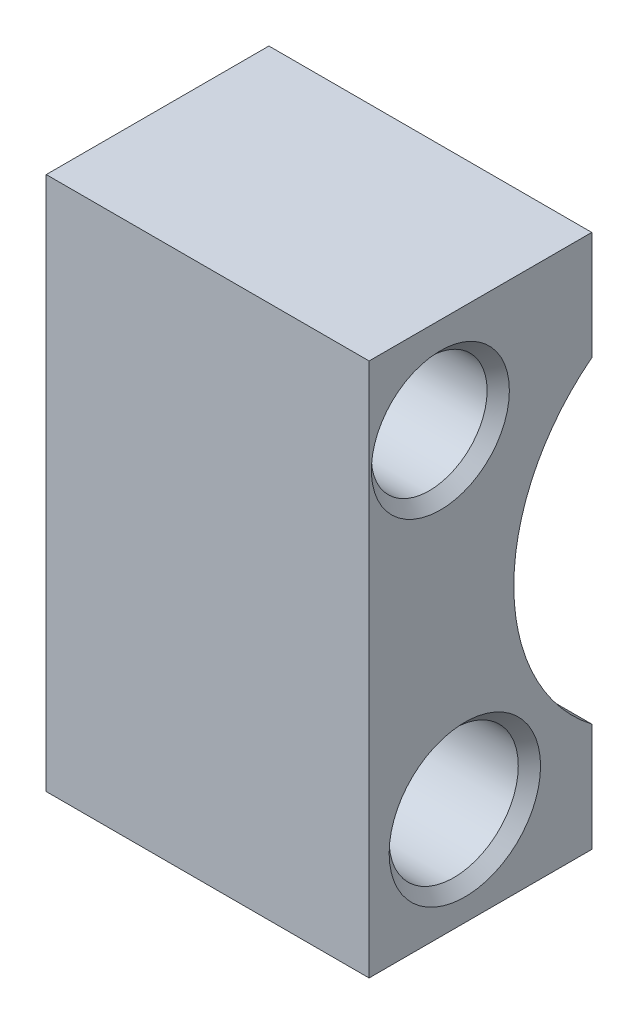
ISO-10303-21;
HEADER;
FILE_DESCRIPTION(('STEP AP214'),'2;1');
FILE_NAME('part.step','',(''),(''),'','','');
FILE_SCHEMA(('AUTOMOTIVE_DESIGN { 1 0 10303 214 1 1 1 1 }'));
ENDSEC;
DATA;
#1=APPLICATION_CONTEXT('core data for automotive mechanical design processes');
#2=APPLICATION_PROTOCOL_DEFINITION('international standard','automotive_design',2000,#1);
#3=PRODUCT_CONTEXT('',#1,'mechanical');
#4=PRODUCT('Part','Part','',(#3));
#5=PRODUCT_RELATED_PRODUCT_CATEGORY('part','',(#4));
#6=PRODUCT_DEFINITION_FORMATION('','',#4);
#7=PRODUCT_DEFINITION_CONTEXT('part definition',#1,'design');
#8=PRODUCT_DEFINITION('design','',#6,#7);
#9=PRODUCT_DEFINITION_SHAPE('','',#8);
#10=(LENGTH_UNIT() NAMED_UNIT(*) SI_UNIT(.MILLI.,.METRE.));
#11=(NAMED_UNIT(*) PLANE_ANGLE_UNIT() SI_UNIT($,.RADIAN.));
#12=(NAMED_UNIT(*) SI_UNIT($,.STERADIAN.) SOLID_ANGLE_UNIT());
#13=UNCERTAINTY_MEASURE_WITH_UNIT(LENGTH_MEASURE(1.E-05),#10,'distance_accuracy_value','');
#14=(GEOMETRIC_REPRESENTATION_CONTEXT(3) GLOBAL_UNCERTAINTY_ASSIGNED_CONTEXT((#13)) GLOBAL_UNIT_ASSIGNED_CONTEXT((#10,
#11,#12)) REPRESENTATION_CONTEXT('',''));
#15=CARTESIAN_POINT('',(0.,0.,0.));
#16=DIRECTION('',(0.,0.,1.));
#17=DIRECTION('',(1.,0.,0.));
#18=AXIS2_PLACEMENT_3D('',#15,#16,#17);
#19=CARTESIAN_POINT('',(-7.251,-7.6,11.2));
#20=DIRECTION('',(1.,0.,0.));
#21=DIRECTION('',(0.,0.,-1.));
#22=AXIS2_PLACEMENT_3D('',#19,#20,#21);
#23=CYLINDRICAL_SURFACE('',#22,1.6);
#24=CARTESIAN_POINT('',(-6.75,-7.6,11.2));
#25=DIRECTION('',(1.,0.,0.));
#26=DIRECTION('',(0.,0.,-1.));
#27=AXIS2_PLACEMENT_3D('',#24,#25,#26);
#28=CIRCLE('',#27,1.6);
#29=CARTESIAN_POINT('',(-6.75,-7.6,9.6));
#30=VERTEX_POINT('',#29);
#31=EDGE_CURVE('E11',#30,#30,#28,.F.);
#32=CARTESIAN_POINT('',(-1.75,-7.6,11.2));
#33=DIRECTION('',(1.,0.,0.));
#34=DIRECTION('',(0.,0.,-1.));
#35=AXIS2_PLACEMENT_3D('',#32,#33,#34);
#36=CIRCLE('',#35,1.6);
#37=CARTESIAN_POINT('',(-1.75,-7.6,9.6));
#38=VERTEX_POINT('',#37);
#39=EDGE_CURVE('E123',#38,#38,#36,.F.);
#40=CARTESIAN_POINT('',(-6.75,-7.6,9.6));
#41=CARTESIAN_POINT('',(-6.69791666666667,-7.6,9.6));
#42=CARTESIAN_POINT('',(-6.64583333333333,-7.6,9.6));
#43=CARTESIAN_POINT('',(-6.54166666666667,-7.6,9.6));
#44=CARTESIAN_POINT('',(-6.48958333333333,-7.6,9.6));
#45=CARTESIAN_POINT('',(-6.38541666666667,-7.6,9.6));
#46=CARTESIAN_POINT('',(-6.33333333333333,-7.6,9.6));
#47=CARTESIAN_POINT('',(-6.22916666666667,-7.6,9.6));
#48=CARTESIAN_POINT('',(-6.17708333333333,-7.6,9.6));
#49=CARTESIAN_POINT('',(-6.07291666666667,-7.6,9.6));
#50=CARTESIAN_POINT('',(-6.02083333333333,-7.6,9.6));
#51=CARTESIAN_POINT('',(-5.91666666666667,-7.6,9.6));
#52=CARTESIAN_POINT('',(-5.86458333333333,-7.6,9.6));
#53=CARTESIAN_POINT('',(-5.76041666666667,-7.6,9.6));
#54=CARTESIAN_POINT('',(-5.70833333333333,-7.6,9.6));
#55=CARTESIAN_POINT('',(-5.60416666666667,-7.6,9.6));
#56=CARTESIAN_POINT('',(-5.55208333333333,-7.6,9.6));
#57=CARTESIAN_POINT('',(-5.44791666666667,-7.6,9.6));
#58=CARTESIAN_POINT('',(-5.39583333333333,-7.6,9.6));
#59=CARTESIAN_POINT('',(-5.29166666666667,-7.6,9.6));
#60=CARTESIAN_POINT('',(-5.23958333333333,-7.6,9.6));
#61=CARTESIAN_POINT('',(-5.13541666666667,-7.6,9.6));
#62=CARTESIAN_POINT('',(-5.08333333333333,-7.6,9.6));
#63=CARTESIAN_POINT('',(-4.97916666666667,-7.6,9.6));
#64=CARTESIAN_POINT('',(-4.92708333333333,-7.6,9.6));
#65=CARTESIAN_POINT('',(-4.82291666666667,-7.6,9.6));
#66=CARTESIAN_POINT('',(-4.77083333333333,-7.6,9.6));
#67=CARTESIAN_POINT('',(-4.66666666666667,-7.6,9.6));
#68=CARTESIAN_POINT('',(-4.61458333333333,-7.6,9.6));
#69=CARTESIAN_POINT('',(-4.51041666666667,-7.6,9.6));
#70=CARTESIAN_POINT('',(-4.45833333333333,-7.6,9.6));
#71=CARTESIAN_POINT('',(-4.35416666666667,-7.6,9.6));
#72=CARTESIAN_POINT('',(-4.30208333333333,-7.6,9.6));
#73=CARTESIAN_POINT('',(-4.19791666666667,-7.6,9.6));
#74=CARTESIAN_POINT('',(-4.14583333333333,-7.6,9.6));
#75=CARTESIAN_POINT('',(-4.04166666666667,-7.6,9.6));
#76=CARTESIAN_POINT('',(-3.98958333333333,-7.6,9.6));
#77=CARTESIAN_POINT('',(-3.88541666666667,-7.6,9.6));
#78=CARTESIAN_POINT('',(-3.83333333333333,-7.6,9.6));
#79=CARTESIAN_POINT('',(-3.72916666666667,-7.6,9.6));
#80=CARTESIAN_POINT('',(-3.67708333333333,-7.6,9.6));
#81=CARTESIAN_POINT('',(-3.57291666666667,-7.6,9.6));
#82=CARTESIAN_POINT('',(-3.52083333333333,-7.6,9.6));
#83=CARTESIAN_POINT('',(-3.41666666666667,-7.6,9.6));
#84=CARTESIAN_POINT('',(-3.36458333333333,-7.6,9.6));
#85=CARTESIAN_POINT('',(-3.26041666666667,-7.6,9.6));
#86=CARTESIAN_POINT('',(-3.20833333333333,-7.6,9.6));
#87=CARTESIAN_POINT('',(-3.10416666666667,-7.6,9.6));
#88=CARTESIAN_POINT('',(-3.05208333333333,-7.6,9.6));
#89=CARTESIAN_POINT('',(-2.94791666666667,-7.6,9.6));
#90=CARTESIAN_POINT('',(-2.89583333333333,-7.6,9.6));
#91=CARTESIAN_POINT('',(-2.79166666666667,-7.6,9.6));
#92=CARTESIAN_POINT('',(-2.73958333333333,-7.6,9.6));
#93=CARTESIAN_POINT('',(-2.63541666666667,-7.6,9.6));
#94=CARTESIAN_POINT('',(-2.58333333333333,-7.6,9.6));
#95=CARTESIAN_POINT('',(-2.47916666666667,-7.6,9.6));
#96=CARTESIAN_POINT('',(-2.42708333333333,-7.6,9.6));
#97=CARTESIAN_POINT('',(-2.32291666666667,-7.6,9.6));
#98=CARTESIAN_POINT('',(-2.27083333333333,-7.6,9.6));
#99=CARTESIAN_POINT('',(-2.16666666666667,-7.6,9.6));
#100=CARTESIAN_POINT('',(-2.11458333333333,-7.6,9.6));
#101=CARTESIAN_POINT('',(-2.01041666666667,-7.6,9.6));
#102=CARTESIAN_POINT('',(-1.95833333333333,-7.6,9.6));
#103=CARTESIAN_POINT('',(-1.85416666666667,-7.6,9.6));
#104=CARTESIAN_POINT('',(-1.80208333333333,-7.6,9.6));
#105=CARTESIAN_POINT('',(-1.75,-7.6,9.6));
#106=B_SPLINE_CURVE_WITH_KNOTS('',3,(#40,#41,#42,#43,#44,#45,#46,#47,#48,#49,#50,#51,#52,#53,
#54,#55,#56,#57,#58,#59,#60,#61,#62,#63,#64,#65,#66,#67,#68,#69,#70,#71,#72,#73,#74,#75,#76,#77,
#78,#79,#80,#81,#82,#83,#84,#85,#86,#87,#88,#89,#90,#91,#92,#93,#94,#95,#96,#97,#98,#99,#100,
#101,#102,#103,#104,#105),.UNSPECIFIED.,.F.,.F.,(4,2,2,2,2,2,2,2,2,2,2,2,2,2,2,2,2,2,2,2,2,2,2,
2,2,2,2,2,2,2,2,2,4),(0.,0.15625,0.3125,0.46875,0.625000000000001,0.781250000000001,0.9375,
1.09375,1.25,1.40625,1.5625,1.71875,1.875,2.03125,2.1875,2.34375,2.5,2.65625,2.8125,2.96875,
3.125,3.28125,3.4375,3.59375,3.75,3.90625,4.0625,4.21875,4.375,4.53125,4.6875,4.84375,5.),.UNSPECIFIED.);
#107=EDGE_CURVE('BSEAM33',#30,#38,#106,.T.);
#108=ORIENTED_EDGE('',*,*,#31,.T.);
#109=ORIENTED_EDGE('',*,*,#39,.F.);
#110=ORIENTED_EDGE('',*,*,#107,.T.);
#111=ORIENTED_EDGE('',*,*,#107,.F.);
#112=EDGE_LOOP('',(#108,#110,#109,#111));
#113=FACE_BOUND('',#112,.T.);
#114=ADVANCED_FACE('F33',(#113),#23,.F.);
#115=CARTESIAN_POINT('',(7.25,12.,15.5));
#116=DIRECTION('',(0.,0.,-1.));
#117=DIRECTION('',(-1.,0.,0.));
#118=AXIS2_PLACEMENT_3D('',#115,#116,#117);
#119=PLANE('',#118);
#120=DIRECTION('',(0.,-1.,0.));
#121=VECTOR('',#120,1.);
#122=CARTESIAN_POINT('',(-7.25,12.,15.5));
#123=LINE('',#122,#121);
#124=CARTESIAN_POINT('',(-7.25,12.,15.5));
#125=VERTEX_POINT('',#124);
#126=CARTESIAN_POINT('',(-7.25,-12.,15.5));
#127=VERTEX_POINT('',#126);
#128=EDGE_CURVE('E119',#125,#127,#123,.T.);
#129=ORIENTED_EDGE('',*,*,#128,.T.);
#130=DIRECTION('',(-1.,0.,0.));
#131=VECTOR('',#130,1.);
#132=CARTESIAN_POINT('',(7.25,-12.,15.5));
#133=LINE('',#132,#131);
#134=CARTESIAN_POINT('',(7.25,-12.,15.5));
#135=VERTEX_POINT('',#134);
#136=EDGE_CURVE('E137',#135,#127,#133,.T.);
#137=ORIENTED_EDGE('',*,*,#136,.F.);
#138=DIRECTION('',(0.,-1.,0.));
#139=VECTOR('',#138,1.);
#140=CARTESIAN_POINT('',(7.25,12.,15.5));
#141=LINE('',#140,#139);
#142=CARTESIAN_POINT('',(7.25,12.,15.5));
#143=VERTEX_POINT('',#142);
#144=EDGE_CURVE('E130',#143,#135,#141,.T.);
#145=ORIENTED_EDGE('',*,*,#144,.F.);
#146=DIRECTION('',(-1.,0.,0.));
#147=VECTOR('',#146,1.);
#148=CARTESIAN_POINT('',(7.25,12.,15.5));
#149=LINE('',#148,#147);
#150=EDGE_CURVE('E115',#143,#125,#149,.T.);
#151=ORIENTED_EDGE('',*,*,#150,.T.);
#152=EDGE_LOOP('',(#129,#137,#145,#151));
#153=FACE_BOUND('',#152,.T.);
#154=ADVANCED_FACE('F187',(#153),#119,.F.);
#155=CARTESIAN_POINT('',(7.25,-12.,15.5));
#156=DIRECTION('',(0.,1.,0.));
#157=DIRECTION('',(0.,0.,1.));
#158=AXIS2_PLACEMENT_3D('',#155,#156,#157);
#159=PLANE('',#158);
#160=DIRECTION('',(0.,0.,-1.));
#161=VECTOR('',#160,1.);
#162=CARTESIAN_POINT('',(-7.25,-12.,15.5));
#163=LINE('',#162,#161);
#164=CARTESIAN_POINT('',(-7.25,-12.,5.49999999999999));
#165=VERTEX_POINT('',#164);
#166=EDGE_CURVE('E122',#127,#165,#163,.T.);
#167=ORIENTED_EDGE('',*,*,#166,.T.);
#168=DIRECTION('',(-1.,0.,0.));
#169=VECTOR('',#168,1.);
#170=CARTESIAN_POINT('',(7.25,-12.,5.49999999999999));
#171=LINE('',#170,#169);
#172=CARTESIAN_POINT('',(7.25,-12.,5.49999999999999));
#173=VERTEX_POINT('',#172);
#174=EDGE_CURVE('E134',#173,#165,#171,.T.);
#175=ORIENTED_EDGE('',*,*,#174,.F.);
#176=DIRECTION('',(0.,0.,-1.));
#177=VECTOR('',#176,1.);
#178=CARTESIAN_POINT('',(7.25,-12.,15.5));
#179=LINE('',#178,#177);
#180=EDGE_CURVE('E88',#135,#173,#179,.T.);
#181=ORIENTED_EDGE('',*,*,#180,.F.);
#182=ORIENTED_EDGE('',*,*,#136,.T.);
#183=EDGE_LOOP('',(#167,#175,#181,#182));
#184=FACE_BOUND('',#183,.T.);
#185=ADVANCED_FACE('F192',(#184),#159,.F.);
#186=CARTESIAN_POINT('',(7.25,-7.12390342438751,5.49999999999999));
#187=DIRECTION('',(0.,0.,1.));
#188=DIRECTION('',(1.,0.,0.));
#189=AXIS2_PLACEMENT_3D('',#186,#187,#188);
#190=PLANE('',#189);
#191=DIRECTION('',(0.,1.,0.));
#192=VECTOR('',#191,1.);
#193=CARTESIAN_POINT('',(-7.25,-7.12390342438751,5.49999999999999));
#194=LINE('',#193,#192);
#195=CARTESIAN_POINT('',(-7.25,-7.12390342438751,5.5));
#196=VERTEX_POINT('',#195);
#197=EDGE_CURVE('E125',#165,#196,#194,.T.);
#198=ORIENTED_EDGE('',*,*,#197,.T.);
#199=DIRECTION('',(-1.,0.,0.));
#200=VECTOR('',#199,1.);
#201=CARTESIAN_POINT('',(7.25,-7.12390342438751,5.5));
#202=LINE('',#201,#200);
#203=CARTESIAN_POINT('',(7.25,-7.12390342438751,5.5));
#204=VERTEX_POINT('',#203);
#205=EDGE_CURVE('E110',#204,#196,#202,.T.);
#206=ORIENTED_EDGE('',*,*,#205,.F.);
#207=DIRECTION('',(0.,1.,0.));
#208=VECTOR('',#207,1.);
#209=CARTESIAN_POINT('',(7.25,-7.12390342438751,5.49999999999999));
#210=LINE('',#209,#208);
#211=EDGE_CURVE('E101',#173,#204,#210,.T.);
#212=ORIENTED_EDGE('',*,*,#211,.F.);
#213=ORIENTED_EDGE('',*,*,#174,.T.);
#214=EDGE_LOOP('',(#198,#206,#212,#213));
#215=FACE_BOUND('',#214,.T.);
#216=ADVANCED_FACE('F216',(#215),#190,.F.);
#217=CARTESIAN_POINT('',(7.25,0.,0.));
#218=DIRECTION('',(-1.,0.,0.));
#219=DIRECTION('',(0.,0.,1.));
#220=AXIS2_PLACEMENT_3D('',#217,#218,#219);
#221=CYLINDRICAL_SURFACE('',#220,9.);
#222=CARTESIAN_POINT('',(-7.25,0.,0.));
#223=DIRECTION('',(-1.,0.,0.));
#224=DIRECTION('',(0.,0.,-1.));
#225=AXIS2_PLACEMENT_3D('',#222,#223,#224);
#226=CIRCLE('',#225,9.);
#227=CARTESIAN_POINT('',(-7.25,7.12390342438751,5.49999999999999));
#228=VERTEX_POINT('',#227);
#229=EDGE_CURVE('E109',#196,#228,#226,.T.);
#230=ORIENTED_EDGE('',*,*,#229,.T.);
#231=DIRECTION('',(-1.,0.,0.));
#232=VECTOR('',#231,1.);
#233=CARTESIAN_POINT('',(7.25,7.12390342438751,5.49999999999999));
#234=LINE('',#233,#232);
#235=CARTESIAN_POINT('',(7.25,7.12390342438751,5.49999999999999));
#236=VERTEX_POINT('',#235);
#237=EDGE_CURVE('E106',#236,#228,#234,.T.);
#238=ORIENTED_EDGE('',*,*,#237,.F.);
#239=CARTESIAN_POINT('',(7.25,0.,0.));
#240=DIRECTION('',(-1.,0.,0.));
#241=DIRECTION('',(0.,0.,-1.));
#242=AXIS2_PLACEMENT_3D('',#239,#240,#241);
#243=CIRCLE('',#242,9.);
#244=EDGE_CURVE('E95',#204,#236,#243,.T.);
#245=ORIENTED_EDGE('',*,*,#244,.F.);
#246=ORIENTED_EDGE('',*,*,#205,.T.);
#247=EDGE_LOOP('',(#230,#238,#245,#246));
#248=FACE_BOUND('',#247,.T.);
#249=ADVANCED_FACE('F107',(#248),#221,.F.);
#250=CARTESIAN_POINT('',(7.25,12.,5.49999999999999));
#251=DIRECTION('',(0.,0.,1.));
#252=DIRECTION('',(1.,0.,0.));
#253=AXIS2_PLACEMENT_3D('',#250,#251,#252);
#254=PLANE('',#253);
#255=DIRECTION('',(0.,1.,0.));
#256=VECTOR('',#255,1.);
#257=CARTESIAN_POINT('',(-7.25,12.,5.49999999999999));
#258=LINE('',#257,#256);
#259=CARTESIAN_POINT('',(-7.25,12.,5.49999999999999));
#260=VERTEX_POINT('',#259);
#261=EDGE_CURVE('E73',#228,#260,#258,.T.);
#262=ORIENTED_EDGE('',*,*,#261,.T.);
#263=DIRECTION('',(-1.,0.,0.));
#264=VECTOR('',#263,1.);
#265=CARTESIAN_POINT('',(7.25,12.,5.49999999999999));
#266=LINE('',#265,#264);
#267=CARTESIAN_POINT('',(7.25,12.,5.49999999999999));
#268=VERTEX_POINT('',#267);
#269=EDGE_CURVE('E111',#268,#260,#266,.T.);
#270=ORIENTED_EDGE('',*,*,#269,.F.);
#271=DIRECTION('',(0.,1.,0.));
#272=VECTOR('',#271,1.);
#273=CARTESIAN_POINT('',(7.25,12.,5.49999999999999));
#274=LINE('',#273,#272);
#275=EDGE_CURVE('E99',#236,#268,#274,.T.);
#276=ORIENTED_EDGE('',*,*,#275,.F.);
#277=ORIENTED_EDGE('',*,*,#237,.T.);
#278=EDGE_LOOP('',(#262,#270,#276,#277));
#279=FACE_BOUND('',#278,.T.);
#280=ADVANCED_FACE('F113',(#279),#254,.F.);
#281=CARTESIAN_POINT('',(7.25,12.,15.5));
#282=DIRECTION('',(0.,-1.,0.));
#283=DIRECTION('',(0.,0.,-1.));
#284=AXIS2_PLACEMENT_3D('',#281,#282,#283);
#285=PLANE('',#284);
#286=DIRECTION('',(0.,0.,1.));
#287=VECTOR('',#286,1.);
#288=CARTESIAN_POINT('',(-7.25,12.,15.5));
#289=LINE('',#288,#287);
#290=EDGE_CURVE('E79',#260,#125,#289,.T.);
#291=ORIENTED_EDGE('',*,*,#290,.T.);
#292=ORIENTED_EDGE('',*,*,#150,.F.);
#293=DIRECTION('',(0.,0.,1.));
#294=VECTOR('',#293,1.);
#295=CARTESIAN_POINT('',(7.25,12.,15.5));
#296=LINE('',#295,#294);
#297=EDGE_CURVE('E50',#268,#143,#296,.T.);
#298=ORIENTED_EDGE('',*,*,#297,.F.);
#299=ORIENTED_EDGE('',*,*,#269,.T.);
#300=EDGE_LOOP('',(#291,#292,#298,#299));
#301=FACE_BOUND('',#300,.T.);
#302=ADVANCED_FACE('F219',(#301),#285,.F.);
#303=CARTESIAN_POINT('',(7.25,0.,0.));
#304=DIRECTION('',(1.,0.,0.));
#305=DIRECTION('',(0.,0.,-1.));
#306=AXIS2_PLACEMENT_3D('',#303,#304,#305);
#307=PLANE('',#306);
#308=CARTESIAN_POINT('',(7.25,-7.6,11.2));
#309=DIRECTION('',(1.,0.,0.));
#310=DIRECTION('',(0.,0.,-1.));
#311=AXIS2_PLACEMENT_3D('',#308,#309,#310);
#312=CIRCLE('',#311,3.4);
#313=CARTESIAN_POINT('',(7.25,-7.6,7.8));
#314=VERTEX_POINT('',#313);
#315=EDGE_CURVE('E148',#314,#314,#312,.F.);
#316=ORIENTED_EDGE('',*,*,#315,.T.);
#317=EDGE_LOOP('',(#316));
#318=FACE_BOUND('',#317,.T.);
#319=CARTESIAN_POINT('',(7.25,7.7,12.3));
#320=DIRECTION('',(1.,0.,0.));
#321=DIRECTION('',(0.,0.,-1.));
#322=AXIS2_PLACEMENT_3D('',#319,#320,#321);
#323=CIRCLE('',#322,3.10000000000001);
#324=CARTESIAN_POINT('',(7.25,7.7,9.19999999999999));
#325=VERTEX_POINT('',#324);
#326=EDGE_CURVE('E145',#325,#325,#323,.F.);
#327=ORIENTED_EDGE('',*,*,#326,.T.);
#328=EDGE_LOOP('',(#327));
#329=FACE_BOUND('',#328,.T.);
#330=ORIENTED_EDGE('',*,*,#144,.T.);
#331=ORIENTED_EDGE('',*,*,#180,.T.);
#332=ORIENTED_EDGE('',*,*,#211,.T.);
#333=ORIENTED_EDGE('',*,*,#244,.T.);
#334=ORIENTED_EDGE('',*,*,#275,.T.);
#335=ORIENTED_EDGE('',*,*,#297,.T.);
#336=EDGE_LOOP('',(#330,#331,#332,#333,#334,#335));
#337=FACE_BOUND('',#336,.T.);
#338=ADVANCED_FACE('F97',(#318,#329,#337),#307,.T.);
#339=CARTESIAN_POINT('',(-7.25,0.,0.));
#340=DIRECTION('',(1.,0.,0.));
#341=DIRECTION('',(0.,0.,-1.));
#342=AXIS2_PLACEMENT_3D('',#339,#340,#341);
#343=PLANE('',#342);
#344=CARTESIAN_POINT('',(-7.25,7.7,12.3));
#345=DIRECTION('',(1.,0.,0.));
#346=DIRECTION('',(0.,0.,-1.));
#347=AXIS2_PLACEMENT_3D('',#344,#345,#346);
#348=CIRCLE('',#347,3.1);
#349=CARTESIAN_POINT('',(-7.25,7.7,9.2));
#350=VERTEX_POINT('',#349);
#351=EDGE_CURVE('E42',#350,#350,#348,.T.);
#352=ORIENTED_EDGE('',*,*,#351,.T.);
#353=EDGE_LOOP('',(#352));
#354=FACE_BOUND('',#353,.T.);
#355=CARTESIAN_POINT('',(-7.25,-7.6,11.2));
#356=DIRECTION('',(1.,0.,0.));
#357=DIRECTION('',(0.,0.,-1.));
#358=AXIS2_PLACEMENT_3D('',#355,#356,#357);
#359=CIRCLE('',#358,2.1);
#360=CARTESIAN_POINT('',(-7.25,-7.6,9.09999999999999));
#361=VERTEX_POINT('',#360);
#362=EDGE_CURVE('E157',#361,#361,#359,.T.);
#363=ORIENTED_EDGE('',*,*,#362,.T.);
#364=EDGE_LOOP('',(#363));
#365=FACE_BOUND('',#364,.T.);
#366=ORIENTED_EDGE('',*,*,#128,.F.);
#367=ORIENTED_EDGE('',*,*,#290,.F.);
#368=ORIENTED_EDGE('',*,*,#261,.F.);
#369=ORIENTED_EDGE('',*,*,#229,.F.);
#370=ORIENTED_EDGE('',*,*,#197,.F.);
#371=ORIENTED_EDGE('',*,*,#166,.F.);
#372=EDGE_LOOP('',(#366,#367,#368,#369,#370,#371));
#373=FACE_BOUND('',#372,.T.);
#374=ADVANCED_FACE('F162',(#354,#365,#373),#343,.F.);
#375=CARTESIAN_POINT('',(-7.251,7.7,12.3));
#376=DIRECTION('',(1.,0.,0.));
#377=DIRECTION('',(0.,0.,-1.));
#378=AXIS2_PLACEMENT_3D('',#375,#376,#377);
#379=CYLINDRICAL_SURFACE('',#378,2.6);
#380=CARTESIAN_POINT('',(6.74999999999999,7.7,12.3));
#381=DIRECTION('',(1.,0.,0.));
#382=DIRECTION('',(0.,0.,-1.));
#383=AXIS2_PLACEMENT_3D('',#380,#381,#382);
#384=CIRCLE('',#383,2.6);
#385=CARTESIAN_POINT('',(6.74999999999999,7.7,9.7));
#386=VERTEX_POINT('',#385);
#387=EDGE_CURVE('E154',#386,#386,#384,.T.);
#388=CARTESIAN_POINT('',(-6.75,7.7,12.3));
#389=DIRECTION('',(1.,0.,0.));
#390=DIRECTION('',(0.,0.,-1.));
#391=AXIS2_PLACEMENT_3D('',#388,#389,#390);
#392=CIRCLE('',#391,2.6);
#393=CARTESIAN_POINT('',(-6.75,7.7,9.7));
#394=VERTEX_POINT('',#393);
#395=EDGE_CURVE('E151',#394,#394,#392,.F.);
#396=CARTESIAN_POINT('',(6.74999999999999,7.7,9.7));
#397=CARTESIAN_POINT('',(6.60937499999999,7.7,9.7));
#398=CARTESIAN_POINT('',(6.46874999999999,7.7,9.7));
#399=CARTESIAN_POINT('',(6.18749999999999,7.7,9.7));
#400=CARTESIAN_POINT('',(6.04687499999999,7.7,9.7));
#401=CARTESIAN_POINT('',(5.76562499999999,7.7,9.7));
#402=CARTESIAN_POINT('',(5.62499999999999,7.7,9.7));
#403=CARTESIAN_POINT('',(5.34374999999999,7.7,9.7));
#404=CARTESIAN_POINT('',(5.20312499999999,7.7,9.7));
#405=CARTESIAN_POINT('',(4.92187499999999,7.7,9.7));
#406=CARTESIAN_POINT('',(4.78124999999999,7.7,9.7));
#407=CARTESIAN_POINT('',(4.49999999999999,7.7,9.7));
#408=CARTESIAN_POINT('',(4.35937499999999,7.7,9.7));
#409=CARTESIAN_POINT('',(4.07812499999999,7.7,9.7));
#410=CARTESIAN_POINT('',(3.93749999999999,7.7,9.7));
#411=CARTESIAN_POINT('',(3.65624999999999,7.7,9.7));
#412=CARTESIAN_POINT('',(3.51562499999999,7.7,9.7));
#413=CARTESIAN_POINT('',(3.23437499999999,7.7,9.7));
#414=CARTESIAN_POINT('',(3.09374999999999,7.7,9.7));
#415=CARTESIAN_POINT('',(2.81249999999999,7.7,9.7));
#416=CARTESIAN_POINT('',(2.67187499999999,7.7,9.7));
#417=CARTESIAN_POINT('',(2.39062499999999,7.7,9.7));
#418=CARTESIAN_POINT('',(2.24999999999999,7.7,9.7));
#419=CARTESIAN_POINT('',(1.96874999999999,7.7,9.7));
#420=CARTESIAN_POINT('',(1.82812499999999,7.7,9.7));
#421=CARTESIAN_POINT('',(1.54687499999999,7.7,9.7));
#422=CARTESIAN_POINT('',(1.40624999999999,7.7,9.7));
#423=CARTESIAN_POINT('',(1.12499999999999,7.7,9.7));
#424=CARTESIAN_POINT('',(0.984374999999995,7.7,9.7));
#425=CARTESIAN_POINT('',(0.703124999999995,7.7,9.7));
#426=CARTESIAN_POINT('',(0.562499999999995,7.7,9.7));
#427=CARTESIAN_POINT('',(0.281249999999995,7.7,9.7));
#428=CARTESIAN_POINT('',(0.140624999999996,7.7,9.7));
#429=CARTESIAN_POINT('',(-0.140625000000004,7.7,9.7));
#430=CARTESIAN_POINT('',(-0.281250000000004,7.7,9.7));
#431=CARTESIAN_POINT('',(-0.562500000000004,7.7,9.7));
#432=CARTESIAN_POINT('',(-0.703125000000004,7.7,9.7));
#433=CARTESIAN_POINT('',(-0.984375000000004,7.7,9.7));
#434=CARTESIAN_POINT('',(-1.125,7.7,9.7));
#435=CARTESIAN_POINT('',(-1.40625,7.7,9.7));
#436=CARTESIAN_POINT('',(-1.546875,7.7,9.7));
#437=CARTESIAN_POINT('',(-1.828125,7.7,9.7));
#438=CARTESIAN_POINT('',(-1.96875,7.7,9.7));
#439=CARTESIAN_POINT('',(-2.25,7.7,9.7));
#440=CARTESIAN_POINT('',(-2.390625,7.7,9.7));
#441=CARTESIAN_POINT('',(-2.671875,7.7,9.7));
#442=CARTESIAN_POINT('',(-2.8125,7.7,9.7));
#443=CARTESIAN_POINT('',(-3.09375,7.7,9.7));
#444=CARTESIAN_POINT('',(-3.234375,7.7,9.7));
#445=CARTESIAN_POINT('',(-3.515625,7.7,9.7));
#446=CARTESIAN_POINT('',(-3.65625,7.7,9.7));
#447=CARTESIAN_POINT('',(-3.9375,7.7,9.7));
#448=CARTESIAN_POINT('',(-4.078125,7.7,9.7));
#449=CARTESIAN_POINT('',(-4.359375,7.7,9.7));
#450=CARTESIAN_POINT('',(-4.5,7.7,9.7));
#451=CARTESIAN_POINT('',(-4.78125,7.7,9.7));
#452=CARTESIAN_POINT('',(-4.921875,7.7,9.7));
#453=CARTESIAN_POINT('',(-5.203125,7.7,9.7));
#454=CARTESIAN_POINT('',(-5.34375,7.7,9.7));
#455=CARTESIAN_POINT('',(-5.625,7.7,9.7));
#456=CARTESIAN_POINT('',(-5.765625,7.7,9.7));
#457=CARTESIAN_POINT('',(-6.046875,7.7,9.7));
#458=CARTESIAN_POINT('',(-6.1875,7.7,9.7));
#459=CARTESIAN_POINT('',(-6.46875,7.7,9.7));
#460=CARTESIAN_POINT('',(-6.609375,7.7,9.7));
#461=CARTESIAN_POINT('',(-6.75,7.7,9.7));
#462=B_SPLINE_CURVE_WITH_KNOTS('',3,(#396,#397,#398,#399,#400,#401,#402,#403,#404,#405,#406,
#407,#408,#409,#410,#411,#412,#413,#414,#415,#416,#417,#418,#419,#420,#421,#422,#423,#424,#425,
#426,#427,#428,#429,#430,#431,#432,#433,#434,#435,#436,#437,#438,#439,#440,#441,#442,#443,#444,
#445,#446,#447,#448,#449,#450,#451,#452,#453,#454,#455,#456,#457,#458,#459,#460,#461),
.UNSPECIFIED.,.F.,.F.,(4,2,2,2,2,2,2,2,2,2,2,2,2,2,2,2,2,2,2,2,2,2,2,2,2,2,2,2,2,2,2,2,4),(0.,
0.421875,0.843749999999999,1.265625,1.6875,2.109375,2.53125,2.953125,3.375,3.796875,4.21875,
4.640625,5.0625,5.484375,5.90625,6.328125,6.75,7.17187499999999,7.59375,8.01562499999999,
8.43749999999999,8.859375,9.28124999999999,9.70312499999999,10.125,10.546875,10.96875,11.390625,
11.8125,12.234375,12.65625,13.078125,13.5),.UNSPECIFIED.);
#463=EDGE_CURVE('BSEAM171',#386,#394,#462,.T.);
#464=ORIENTED_EDGE('',*,*,#387,.T.);
#465=ORIENTED_EDGE('',*,*,#395,.T.);
#466=ORIENTED_EDGE('',*,*,#463,.T.);
#467=ORIENTED_EDGE('',*,*,#463,.F.);
#468=EDGE_LOOP('',(#464,#466,#465,#467));
#469=FACE_BOUND('',#468,.T.);
#470=ADVANCED_FACE('F171',(#469),#379,.F.);
#471=CARTESIAN_POINT('',(-1.75,-7.6,11.2));
#472=DIRECTION('',(1.,0.,0.));
#473=DIRECTION('',(0.,0.,-1.));
#474=AXIS2_PLACEMENT_3D('',#471,#472,#473);
#475=PLANE('',#474);
#476=CARTESIAN_POINT('',(-1.75,-7.6,11.2));
#477=DIRECTION('',(1.,0.,0.));
#478=DIRECTION('',(0.,0.,-1.));
#479=AXIS2_PLACEMENT_3D('',#476,#477,#478);
#480=CIRCLE('',#479,2.9);
#481=CARTESIAN_POINT('',(-1.75,-7.6,8.3));
#482=VERTEX_POINT('',#481);
#483=EDGE_CURVE('E142',#482,#482,#480,.T.);
#484=ORIENTED_EDGE('',*,*,#483,.T.);
#485=EDGE_LOOP('',(#484));
#486=FACE_BOUND('',#485,.T.);
#487=ORIENTED_EDGE('',*,*,#39,.T.);
#488=EDGE_LOOP('',(#487));
#489=FACE_BOUND('',#488,.T.);
#490=ADVANCED_FACE('F173',(#486,#489),#475,.T.);
#491=CARTESIAN_POINT('',(-1.75,-7.6,11.2));
#492=DIRECTION('',(1.,0.,0.));
#493=DIRECTION('',(0.,0.,-1.));
#494=AXIS2_PLACEMENT_3D('',#491,#492,#493);
#495=CYLINDRICAL_SURFACE('',#494,2.9);
#496=CARTESIAN_POINT('',(6.75,-7.6,11.2));
#497=DIRECTION('',(1.,0.,0.));
#498=DIRECTION('',(0.,0.,-1.));
#499=AXIS2_PLACEMENT_3D('',#496,#497,#498);
#500=CIRCLE('',#499,2.9);
#501=CARTESIAN_POINT('',(6.75,-7.6,8.3));
#502=VERTEX_POINT('',#501);
#503=EDGE_CURVE('E139',#502,#502,#500,.T.);
#504=ORIENTED_EDGE('',*,*,#503,.T.);
#505=EDGE_LOOP('',(#504));
#506=FACE_BOUND('',#505,.T.);
#507=ORIENTED_EDGE('',*,*,#483,.F.);
#508=EDGE_LOOP('',(#507));
#509=FACE_BOUND('',#508,.T.);
#510=ADVANCED_FACE('F180',(#506,#509),#495,.F.);
#511=CARTESIAN_POINT('',(6.75,-7.6,11.2));
#512=DIRECTION('',(1.,0.,0.));
#513=DIRECTION('',(0.,0.,-1.));
#514=AXIS2_PLACEMENT_3D('',#511,#512,#513);
#515=CONICAL_SURFACE('',#514,2.9,0.785398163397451);
#516=ORIENTED_EDGE('',*,*,#315,.F.);
#517=EDGE_LOOP('',(#516));
#518=FACE_BOUND('',#517,.T.);
#519=ORIENTED_EDGE('',*,*,#503,.F.);
#520=EDGE_LOOP('',(#519));
#521=FACE_BOUND('',#520,.T.);
#522=ADVANCED_FACE('F198',(#518,#521),#515,.F.);
#523=CARTESIAN_POINT('',(6.74999999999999,7.7,12.3));
#524=DIRECTION('',(1.,0.,0.));
#525=DIRECTION('',(0.,0.,-1.));
#526=AXIS2_PLACEMENT_3D('',#523,#524,#525);
#527=CONICAL_SURFACE('',#526,2.6,0.78539816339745);
#528=ORIENTED_EDGE('',*,*,#326,.F.);
#529=EDGE_LOOP('',(#528));
#530=FACE_BOUND('',#529,.T.);
#531=ORIENTED_EDGE('',*,*,#387,.F.);
#532=EDGE_LOOP('',(#531));
#533=FACE_BOUND('',#532,.T.);
#534=ADVANCED_FACE('F168',(#530,#533),#527,.F.);
#535=CARTESIAN_POINT('',(-6.75,7.7,12.3));
#536=DIRECTION('',(-1.,0.,0.));
#537=DIRECTION('',(0.,0.,1.));
#538=AXIS2_PLACEMENT_3D('',#535,#536,#537);
#539=CONICAL_SURFACE('',#538,2.6,0.78539816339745);
#540=ORIENTED_EDGE('',*,*,#351,.F.);
#541=EDGE_LOOP('',(#540));
#542=FACE_BOUND('',#541,.T.);
#543=ORIENTED_EDGE('',*,*,#395,.F.);
#544=EDGE_LOOP('',(#543));
#545=FACE_BOUND('',#544,.T.);
#546=ADVANCED_FACE('F165',(#542,#545),#539,.F.);
#547=CARTESIAN_POINT('',(-6.75,-7.6,11.2));
#548=DIRECTION('',(-1.,0.,0.));
#549=DIRECTION('',(0.,0.,1.));
#550=AXIS2_PLACEMENT_3D('',#547,#548,#549);
#551=CONICAL_SURFACE('',#550,1.6,0.78539816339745);
#552=ORIENTED_EDGE('',*,*,#362,.F.);
#553=EDGE_LOOP('',(#552));
#554=FACE_BOUND('',#553,.T.);
#555=ORIENTED_EDGE('',*,*,#31,.F.);
#556=EDGE_LOOP('',(#555));
#557=FACE_BOUND('',#556,.T.);
#558=ADVANCED_FACE('F35',(#554,#557),#551,.F.);
#559=CLOSED_SHELL('',(#114,#154,#185,#216,#249,#280,#302,#338,#374,#470,#490,#510,#522,#534,
#546,#558));
#560=MANIFOLD_SOLID_BREP('B2',#559);
#561=ADVANCED_BREP_SHAPE_REPRESENTATION('',(#18,#560),#14);
#562=SHAPE_DEFINITION_REPRESENTATION(#9,#561);
ENDSEC;
END-ISO-10303-21;
